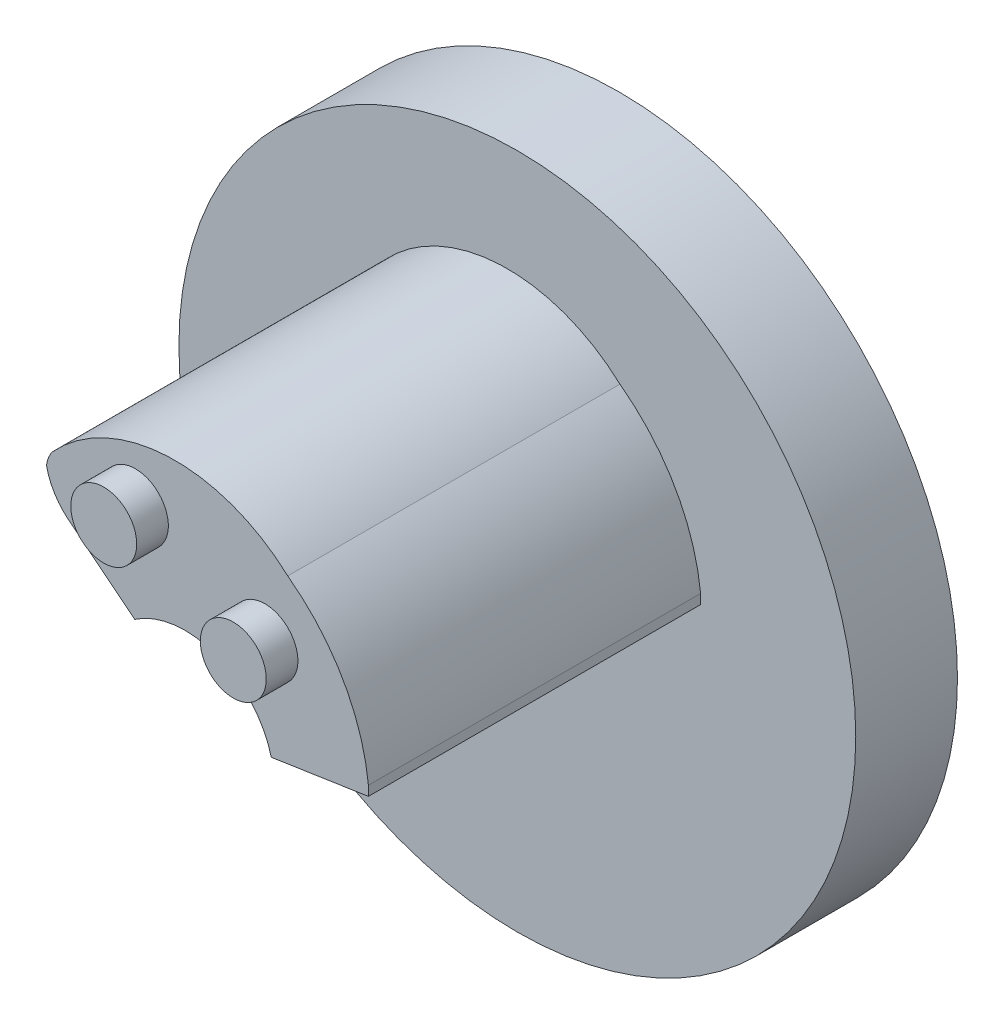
ISO-10303-21;
HEADER;
FILE_DESCRIPTION(('STEP AP214'),'2;1');
FILE_NAME('part.step','',(''),(''),'','','');
FILE_SCHEMA(('AUTOMOTIVE_DESIGN { 1 0 10303 214 1 1 1 1 }'));
ENDSEC;
DATA;
#1=APPLICATION_CONTEXT('core data for automotive mechanical design processes');
#2=APPLICATION_PROTOCOL_DEFINITION('international standard','automotive_design',2000,#1);
#3=PRODUCT_CONTEXT('',#1,'mechanical');
#4=PRODUCT('Part','Part','',(#3));
#5=PRODUCT_RELATED_PRODUCT_CATEGORY('part','',(#4));
#6=PRODUCT_DEFINITION_FORMATION('','',#4);
#7=PRODUCT_DEFINITION_CONTEXT('part definition',#1,'design');
#8=PRODUCT_DEFINITION('design','',#6,#7);
#9=PRODUCT_DEFINITION_SHAPE('','',#8);
#10=(LENGTH_UNIT() NAMED_UNIT(*) SI_UNIT(.MILLI.,.METRE.));
#11=(NAMED_UNIT(*) PLANE_ANGLE_UNIT() SI_UNIT($,.RADIAN.));
#12=(NAMED_UNIT(*) SI_UNIT($,.STERADIAN.) SOLID_ANGLE_UNIT());
#13=UNCERTAINTY_MEASURE_WITH_UNIT(LENGTH_MEASURE(1.E-05),#10,'distance_accuracy_value','');
#14=(GEOMETRIC_REPRESENTATION_CONTEXT(3) GLOBAL_UNCERTAINTY_ASSIGNED_CONTEXT((#13)) GLOBAL_UNIT_ASSIGNED_CONTEXT((#10,
#11,#12)) REPRESENTATION_CONTEXT('',''));
#15=CARTESIAN_POINT('',(0.,0.,0.));
#16=DIRECTION('',(0.,0.,1.));
#17=DIRECTION('',(1.,0.,0.));
#18=AXIS2_PLACEMENT_3D('',#15,#16,#17);
#19=CARTESIAN_POINT('',(-4.63184266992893,15.3950716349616,32.004));
#20=DIRECTION('',(0.,0.,-1.));
#21=DIRECTION('',(-1.,0.,0.));
#22=AXIS2_PLACEMENT_3D('',#19,#20,#21);
#23=CYLINDRICAL_SURFACE('',#22,6.11132036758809);
#24=DIRECTION('',(0.,0.,1.));
#25=VECTOR('',#24,1.);
#26=CARTESIAN_POINT('',(-10.6121911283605,14.1366325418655,17.526));
#27=LINE('',#26,#25);
#28=CARTESIAN_POINT('',(-10.6121911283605,14.1366325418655,0.));
#29=VERTEX_POINT('',#28);
#30=CARTESIAN_POINT('',(-10.6121911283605,14.1366325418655,32.004));
#31=VERTEX_POINT('',#30);
#32=EDGE_CURVE('E148',#29,#31,#27,.T.);
#33=ORIENTED_EDGE('',*,*,#32,.F.);
#34=CARTESIAN_POINT('',(-4.63184266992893,15.3950716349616,0.));
#35=DIRECTION('',(0.,0.,1.));
#36=DIRECTION('',(1.,0.,0.));
#37=AXIS2_PLACEMENT_3D('',#34,#35,#36);
#38=CIRCLE('',#37,6.11132036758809);
#39=CARTESIAN_POINT('',(-8.45110853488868,10.624176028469,0.));
#40=VERTEX_POINT('',#39);
#41=EDGE_CURVE('E166',#29,#40,#38,.T.);
#42=ORIENTED_EDGE('',*,*,#41,.T.);
#43=DIRECTION('',(0.,0.,-1.));
#44=VECTOR('',#43,1.);
#45=CARTESIAN_POINT('',(-8.45110853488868,10.624176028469,32.004));
#46=LINE('',#45,#44);
#47=CARTESIAN_POINT('',(-8.45110853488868,10.624176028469,32.004));
#48=VERTEX_POINT('',#47);
#49=EDGE_CURVE('E179',#48,#40,#46,.T.);
#50=ORIENTED_EDGE('',*,*,#49,.F.);
#51=CARTESIAN_POINT('',(-4.63184266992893,15.3950716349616,32.004));
#52=DIRECTION('',(0.,0.,1.));
#53=DIRECTION('',(1.,0.,0.));
#54=AXIS2_PLACEMENT_3D('',#51,#52,#53);
#55=CIRCLE('',#54,6.11132036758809);
#56=EDGE_CURVE('E169',#31,#48,#55,.T.);
#57=ORIENTED_EDGE('',*,*,#56,.F.);
#58=EDGE_LOOP('',(#33,#42,#50,#57));
#59=FACE_BOUND('',#58,.T.);
#60=ADVANCED_FACE('F42',(#59),#23,.T.);
#61=CARTESIAN_POINT('',(2.7435533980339,-1.51919399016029,32.004));
#62=DIRECTION('',(0.,0.,-1.));
#63=DIRECTION('',(-1.,0.,0.));
#64=AXIS2_PLACEMENT_3D('',#61,#62,#63);
#65=CYLINDRICAL_SURFACE('',#64,8.57250000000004);
#66=DIRECTION('',(0.,0.,-1.));
#67=VECTOR('',#66,1.);
#68=CARTESIAN_POINT('',(-2.10937907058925,5.54740368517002,32.004));
#69=LINE('',#68,#67);
#70=CARTESIAN_POINT('',(-2.10937907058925,5.54740368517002,32.004));
#71=VERTEX_POINT('',#70);
#72=CARTESIAN_POINT('',(-2.10937907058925,5.54740368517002,0.));
#73=VERTEX_POINT('',#72);
#74=EDGE_CURVE('E110',#71,#73,#69,.T.);
#75=ORIENTED_EDGE('',*,*,#74,.T.);
#76=CARTESIAN_POINT('',(2.7435533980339,-1.51919399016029,0.));
#77=DIRECTION('',(0.,0.,1.));
#78=DIRECTION('',(1.,0.,0.));
#79=AXIS2_PLACEMENT_3D('',#76,#77,#78);
#80=CIRCLE('',#79,8.57250000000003);
#81=CARTESIAN_POINT('',(11.0456569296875,0.616884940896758,0.));
#82=VERTEX_POINT('',#81);
#83=EDGE_CURVE('E105',#73,#82,#80,.T.);
#84=ORIENTED_EDGE('',*,*,#83,.T.);
#85=DIRECTION('',(0.,0.,1.));
#86=VECTOR('',#85,1.);
#87=CARTESIAN_POINT('',(11.0456569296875,0.616884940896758,-162.038491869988));
#88=LINE('',#87,#86);
#89=CARTESIAN_POINT('',(11.0456569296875,0.616884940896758,32.004));
#90=VERTEX_POINT('',#89);
#91=EDGE_CURVE('E109',#82,#90,#88,.T.);
#92=ORIENTED_EDGE('',*,*,#91,.T.);
#93=CARTESIAN_POINT('',(2.7435533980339,-1.51919399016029,32.004));
#94=DIRECTION('',(0.,0.,1.));
#95=DIRECTION('',(1.,0.,0.));
#96=AXIS2_PLACEMENT_3D('',#93,#94,#95);
#97=CIRCLE('',#96,8.57250000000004);
#98=EDGE_CURVE('E64',#90,#71,#97,.T.);
#99=ORIENTED_EDGE('',*,*,#98,.T.);
#100=EDGE_LOOP('',(#75,#84,#92,#99));
#101=FACE_BOUND('',#100,.T.);
#102=CARTESIAN_POINT('',(2.7435533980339,-1.51919399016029,-9.8));
#103=DIRECTION('',(0.,0.,1.));
#104=DIRECTION('',(1.,0.,0.));
#105=AXIS2_PLACEMENT_3D('',#102,#103,#104);
#106=CIRCLE('',#105,8.57250000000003);
#107=CARTESIAN_POINT('',(11.3160533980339,-1.51919399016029,-9.8));
#108=VERTEX_POINT('',#107);
#109=EDGE_CURVE('E115',#108,#108,#106,.T.);
#110=ORIENTED_EDGE('',*,*,#109,.F.);
#111=EDGE_LOOP('',(#110));
#112=FACE_BOUND('',#111,.T.);
#113=ADVANCED_FACE('F107',(#101,#112),#65,.F.);
#114=CARTESIAN_POINT('',(-1.60417169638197,-0.20353868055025,32.004));
#115=DIRECTION('',(0.,0.,1.));
#116=DIRECTION('',(1.,0.,0.));
#117=AXIS2_PLACEMENT_3D('',#114,#115,#116);
#118=PLANE('',#117);
#119=CARTESIAN_POINT('',(10.4302717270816,9.94696029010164,32.004));
#120=DIRECTION('',(0.,0.,1.));
#121=DIRECTION('',(1.,0.,0.));
#122=AXIS2_PLACEMENT_3D('',#119,#120,#121);
#123=CIRCLE('',#122,3.175);
#124=CARTESIAN_POINT('',(7.25527172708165,9.94696029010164,32.004));
#125=VERTEX_POINT('',#124);
#126=EDGE_CURVE('E157',#125,#125,#123,.T.);
#127=ORIENTED_EDGE('',*,*,#126,.F.);
#128=EDGE_LOOP('',(#127));
#129=FACE_BOUND('',#128,.T.);
#130=CARTESIAN_POINT('',(-2.0510247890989,14.9690204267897,32.004));
#131=DIRECTION('',(0.,0.,1.));
#132=DIRECTION('',(1.,0.,0.));
#133=AXIS2_PLACEMENT_3D('',#130,#131,#132);
#134=CIRCLE('',#133,3.175);
#135=CARTESIAN_POINT('',(-5.2260247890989,14.9690204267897,32.004));
#136=VERTEX_POINT('',#135);
#137=EDGE_CURVE('E160',#136,#136,#134,.T.);
#138=ORIENTED_EDGE('',*,*,#137,.F.);
#139=EDGE_LOOP('',(#138));
#140=FACE_BOUND('',#139,.T.);
#141=CARTESIAN_POINT('',(1.78231513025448,4.68272606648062,32.004));
#142=DIRECTION('',(0.,0.,1.));
#143=DIRECTION('',(1.,0.,0.));
#144=AXIS2_PLACEMENT_3D('',#141,#142,#143);
#145=CIRCLE('',#144,16.0701641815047);
#146=CARTESIAN_POINT('',(12.6284180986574,16.5407287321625,32.004));
#147=VERTEX_POINT('',#146);
#148=CARTESIAN_POINT('',(-10.0396309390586,15.5681184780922,32.004));
#149=VERTEX_POINT('',#148);
#150=EDGE_CURVE('E188',#147,#149,#145,.T.);
#151=ORIENTED_EDGE('',*,*,#150,.T.);
#152=CARTESIAN_POINT('',(-7.69142193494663,13.7986427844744,32.004));
#153=DIRECTION('',(0.,0.,1.));
#154=DIRECTION('',(1.,0.,0.));
#155=AXIS2_PLACEMENT_3D('',#152,#153,#154);
#156=CIRCLE('',#155,2.94026015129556);
#157=EDGE_CURVE('E144',#149,#31,#156,.T.);
#158=ORIENTED_EDGE('',*,*,#157,.T.);
#159=ORIENTED_EDGE('',*,*,#56,.T.);
#160=DIRECTION('',(-0.780665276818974,0.624949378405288,0.));
#161=VECTOR('',#160,1.);
#162=CARTESIAN_POINT('',(-2.10937907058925,5.54740368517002,32.004));
#163=LINE('',#162,#161);
#164=EDGE_CURVE('E171',#71,#48,#163,.T.);
#165=ORIENTED_EDGE('',*,*,#164,.F.);
#166=ORIENTED_EDGE('',*,*,#98,.F.);
#167=DIRECTION('',(0.988724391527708,0.149746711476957,0.));
#168=VECTOR('',#167,1.);
#169=CARTESIAN_POINT('',(-1.44198142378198,-1.27442349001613,32.004));
#170=LINE('',#169,#168);
#171=CARTESIAN_POINT('',(20.4006112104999,2.03373442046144,32.004));
#172=VERTEX_POINT('',#171);
#173=EDGE_CURVE('E121',#90,#172,#170,.T.);
#174=ORIENTED_EDGE('',*,*,#173,.T.);
#175=DIRECTION('',(0.,1.,0.));
#176=VECTOR('',#175,1.);
#177=CARTESIAN_POINT('',(20.4006112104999,-0.20353868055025,32.004));
#178=LINE('',#177,#176);
#179=CARTESIAN_POINT('',(20.4006112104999,2.96651204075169,32.004));
#180=VERTEX_POINT('',#179);
#181=EDGE_CURVE('E182',#172,#180,#178,.T.);
#182=ORIENTED_EDGE('',*,*,#181,.T.);
#183=CARTESIAN_POINT('',(1.12448254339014,0.941745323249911,32.004));
#184=DIRECTION('',(0.,0.,1.));
#185=DIRECTION('',(1.,0.,0.));
#186=AXIS2_PLACEMENT_3D('',#183,#184,#185);
#187=CIRCLE('',#186,19.3821778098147);
#188=EDGE_CURVE('E185',#180,#147,#187,.T.);
#189=ORIENTED_EDGE('',*,*,#188,.T.);
#190=EDGE_LOOP('',(#151,#158,#159,#165,#166,#174,#182,#189));
#191=FACE_BOUND('',#190,.T.);
#192=ADVANCED_FACE('F225',(#129,#140,#191),#118,.T.);
#193=CARTESIAN_POINT('',(-2.10937907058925,5.54740368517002,32.004));
#194=DIRECTION('',(-0.624949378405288,-0.780665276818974,0.));
#195=DIRECTION('',(0.780665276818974,-0.624949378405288,0.));
#196=AXIS2_PLACEMENT_3D('',#193,#194,#195);
#197=PLANE('',#196);
#198=DIRECTION('',(-0.780665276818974,0.624949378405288,0.));
#199=VECTOR('',#198,1.);
#200=CARTESIAN_POINT('',(-2.10937907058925,5.54740368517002,0.));
#201=LINE('',#200,#199);
#202=EDGE_CURVE('E172',#73,#40,#201,.T.);
#203=ORIENTED_EDGE('',*,*,#202,.F.);
#204=ORIENTED_EDGE('',*,*,#74,.F.);
#205=ORIENTED_EDGE('',*,*,#164,.T.);
#206=ORIENTED_EDGE('',*,*,#49,.T.);
#207=EDGE_LOOP('',(#203,#204,#205,#206));
#208=FACE_BOUND('',#207,.T.);
#209=ADVANCED_FACE('F233',(#208),#197,.T.);
#210=CARTESIAN_POINT('',(-2.0510247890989,14.9690204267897,35.052));
#211=DIRECTION('',(0.,0.,-1.));
#212=DIRECTION('',(-1.,0.,0.));
#213=AXIS2_PLACEMENT_3D('',#210,#211,#212);
#214=CYLINDRICAL_SURFACE('',#213,3.175);
#215=CARTESIAN_POINT('',(-2.0510247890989,14.9690204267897,35.052));
#216=DIRECTION('',(0.,0.,1.));
#217=DIRECTION('',(1.,0.,0.));
#218=AXIS2_PLACEMENT_3D('',#215,#216,#217);
#219=CIRCLE('',#218,3.175);
#220=CARTESIAN_POINT('',(-5.2260247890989,14.9690204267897,35.052));
#221=VERTEX_POINT('',#220);
#222=EDGE_CURVE('E163',#221,#221,#219,.T.);
#223=CARTESIAN_POINT('',(-5.2260247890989,14.9690204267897,35.052));
#224=CARTESIAN_POINT('',(-5.2260247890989,14.9690204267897,35.02025));
#225=CARTESIAN_POINT('',(-5.2260247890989,14.9690204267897,34.9885));
#226=CARTESIAN_POINT('',(-5.2260247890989,14.9690204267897,34.925));
#227=CARTESIAN_POINT('',(-5.2260247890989,14.9690204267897,34.89325));
#228=CARTESIAN_POINT('',(-5.2260247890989,14.9690204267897,34.82975));
#229=CARTESIAN_POINT('',(-5.2260247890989,14.9690204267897,34.798));
#230=CARTESIAN_POINT('',(-5.2260247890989,14.9690204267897,34.7345));
#231=CARTESIAN_POINT('',(-5.2260247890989,14.9690204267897,34.70275));
#232=CARTESIAN_POINT('',(-5.2260247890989,14.9690204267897,34.63925));
#233=CARTESIAN_POINT('',(-5.2260247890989,14.9690204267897,34.6075));
#234=CARTESIAN_POINT('',(-5.2260247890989,14.9690204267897,34.544));
#235=CARTESIAN_POINT('',(-5.2260247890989,14.9690204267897,34.51225));
#236=CARTESIAN_POINT('',(-5.2260247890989,14.9690204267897,34.44875));
#237=CARTESIAN_POINT('',(-5.2260247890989,14.9690204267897,34.417));
#238=CARTESIAN_POINT('',(-5.2260247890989,14.9690204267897,34.3535));
#239=CARTESIAN_POINT('',(-5.2260247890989,14.9690204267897,34.32175));
#240=CARTESIAN_POINT('',(-5.2260247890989,14.9690204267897,34.25825));
#241=CARTESIAN_POINT('',(-5.2260247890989,14.9690204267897,34.2265));
#242=CARTESIAN_POINT('',(-5.2260247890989,14.9690204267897,34.163));
#243=CARTESIAN_POINT('',(-5.2260247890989,14.9690204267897,34.13125));
#244=CARTESIAN_POINT('',(-5.2260247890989,14.9690204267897,34.06775));
#245=CARTESIAN_POINT('',(-5.2260247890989,14.9690204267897,34.036));
#246=CARTESIAN_POINT('',(-5.2260247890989,14.9690204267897,33.9725));
#247=CARTESIAN_POINT('',(-5.2260247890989,14.9690204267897,33.94075));
#248=CARTESIAN_POINT('',(-5.2260247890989,14.9690204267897,33.87725));
#249=CARTESIAN_POINT('',(-5.2260247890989,14.9690204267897,33.8455));
#250=CARTESIAN_POINT('',(-5.2260247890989,14.9690204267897,33.782));
#251=CARTESIAN_POINT('',(-5.2260247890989,14.9690204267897,33.75025));
#252=CARTESIAN_POINT('',(-5.2260247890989,14.9690204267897,33.68675));
#253=CARTESIAN_POINT('',(-5.2260247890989,14.9690204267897,33.655));
#254=CARTESIAN_POINT('',(-5.2260247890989,14.9690204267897,33.5915));
#255=CARTESIAN_POINT('',(-5.2260247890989,14.9690204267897,33.55975));
#256=CARTESIAN_POINT('',(-5.2260247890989,14.9690204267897,33.49625));
#257=CARTESIAN_POINT('',(-5.2260247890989,14.9690204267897,33.4645));
#258=CARTESIAN_POINT('',(-5.2260247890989,14.9690204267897,33.401));
#259=CARTESIAN_POINT('',(-5.2260247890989,14.9690204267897,33.36925));
#260=CARTESIAN_POINT('',(-5.2260247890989,14.9690204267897,33.30575));
#261=CARTESIAN_POINT('',(-5.2260247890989,14.9690204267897,33.274));
#262=CARTESIAN_POINT('',(-5.2260247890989,14.9690204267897,33.2105));
#263=CARTESIAN_POINT('',(-5.2260247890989,14.9690204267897,33.17875));
#264=CARTESIAN_POINT('',(-5.2260247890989,14.9690204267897,33.11525));
#265=CARTESIAN_POINT('',(-5.2260247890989,14.9690204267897,33.0835));
#266=CARTESIAN_POINT('',(-5.2260247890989,14.9690204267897,33.02));
#267=CARTESIAN_POINT('',(-5.2260247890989,14.9690204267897,32.98825));
#268=CARTESIAN_POINT('',(-5.2260247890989,14.9690204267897,32.92475));
#269=CARTESIAN_POINT('',(-5.2260247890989,14.9690204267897,32.893));
#270=CARTESIAN_POINT('',(-5.2260247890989,14.9690204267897,32.8295));
#271=CARTESIAN_POINT('',(-5.2260247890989,14.9690204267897,32.79775));
#272=CARTESIAN_POINT('',(-5.2260247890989,14.9690204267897,32.73425));
#273=CARTESIAN_POINT('',(-5.2260247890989,14.9690204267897,32.7025));
#274=CARTESIAN_POINT('',(-5.2260247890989,14.9690204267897,32.639));
#275=CARTESIAN_POINT('',(-5.2260247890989,14.9690204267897,32.60725));
#276=CARTESIAN_POINT('',(-5.2260247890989,14.9690204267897,32.54375));
#277=CARTESIAN_POINT('',(-5.2260247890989,14.9690204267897,32.512));
#278=CARTESIAN_POINT('',(-5.2260247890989,14.9690204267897,32.4485));
#279=CARTESIAN_POINT('',(-5.2260247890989,14.9690204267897,32.41675));
#280=CARTESIAN_POINT('',(-5.2260247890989,14.9690204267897,32.35325));
#281=CARTESIAN_POINT('',(-5.2260247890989,14.9690204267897,32.3215));
#282=CARTESIAN_POINT('',(-5.2260247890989,14.9690204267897,32.258));
#283=CARTESIAN_POINT('',(-5.2260247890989,14.9690204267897,32.22625));
#284=CARTESIAN_POINT('',(-5.2260247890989,14.9690204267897,32.16275));
#285=CARTESIAN_POINT('',(-5.2260247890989,14.9690204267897,32.131));
#286=CARTESIAN_POINT('',(-5.2260247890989,14.9690204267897,32.0675));
#287=CARTESIAN_POINT('',(-5.2260247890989,14.9690204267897,32.03575));
#288=CARTESIAN_POINT('',(-5.2260247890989,14.9690204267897,32.004));
#289=B_SPLINE_CURVE_WITH_KNOTS('',3,(#223,#224,#225,#226,#227,#228,#229,#230,#231,#232,#233,
#234,#235,#236,#237,#238,#239,#240,#241,#242,#243,#244,#245,#246,#247,#248,#249,#250,#251,#252,
#253,#254,#255,#256,#257,#258,#259,#260,#261,#262,#263,#264,#265,#266,#267,#268,#269,#270,#271,
#272,#273,#274,#275,#276,#277,#278,#279,#280,#281,#282,#283,#284,#285,#286,#287,#288),
.UNSPECIFIED.,.F.,.F.,(4,2,2,2,2,2,2,2,2,2,2,2,2,2,2,2,2,2,2,2,2,2,2,2,2,2,2,2,2,2,2,2,4),(0.,
0.0952500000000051,0.190500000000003,0.285750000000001,0.381000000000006,0.476250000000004,
0.571500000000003,0.666750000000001,0.762000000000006,0.857250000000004,0.952500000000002,
1.04775000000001,1.14300000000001,1.23825,1.3335,1.42875000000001,1.524,1.61925,
1.71450000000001,1.80975000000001,1.905,2.00025,2.09550000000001,2.19075000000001,2.286,2.38125,
2.47650000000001,2.57175,2.667,2.76225000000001,2.85750000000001,2.95275,3.048),.UNSPECIFIED.);
#290=EDGE_CURVE('BSEAM320',#221,#136,#289,.T.);
#291=ORIENTED_EDGE('',*,*,#222,.F.);
#292=ORIENTED_EDGE('',*,*,#137,.T.);
#293=ORIENTED_EDGE('',*,*,#290,.T.);
#294=ORIENTED_EDGE('',*,*,#290,.F.);
#295=EDGE_LOOP('',(#291,#293,#292,#294));
#296=FACE_BOUND('',#295,.T.);
#297=ADVANCED_FACE('F320',(#296),#214,.T.);
#298=CARTESIAN_POINT('',(-2.0510247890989,14.9690204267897,35.052));
#299=DIRECTION('',(0.,0.,1.));
#300=DIRECTION('',(1.,0.,0.));
#301=AXIS2_PLACEMENT_3D('',#298,#299,#300);
#302=PLANE('',#301);
#303=ORIENTED_EDGE('',*,*,#222,.T.);
#304=EDGE_LOOP('',(#303));
#305=FACE_BOUND('',#304,.T.);
#306=ADVANCED_FACE('F325',(#305),#302,.T.);
#307=CARTESIAN_POINT('',(10.4302717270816,9.94696029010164,35.052));
#308=DIRECTION('',(0.,0.,-1.));
#309=DIRECTION('',(-1.,0.,0.));
#310=AXIS2_PLACEMENT_3D('',#307,#308,#309);
#311=CYLINDRICAL_SURFACE('',#310,3.175);
#312=CARTESIAN_POINT('',(10.4302717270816,9.94696029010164,35.052));
#313=DIRECTION('',(0.,0.,1.));
#314=DIRECTION('',(1.,0.,0.));
#315=AXIS2_PLACEMENT_3D('',#312,#313,#314);
#316=CIRCLE('',#315,3.175);
#317=CARTESIAN_POINT('',(7.25527172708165,9.94696029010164,35.052));
#318=VERTEX_POINT('',#317);
#319=EDGE_CURVE('E154',#318,#318,#316,.T.);
#320=CARTESIAN_POINT('',(7.25527172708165,9.94696029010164,35.052));
#321=CARTESIAN_POINT('',(7.25527172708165,9.94696029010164,35.02025));
#322=CARTESIAN_POINT('',(7.25527172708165,9.94696029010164,34.9885));
#323=CARTESIAN_POINT('',(7.25527172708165,9.94696029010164,34.925));
#324=CARTESIAN_POINT('',(7.25527172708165,9.94696029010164,34.89325));
#325=CARTESIAN_POINT('',(7.25527172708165,9.94696029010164,34.82975));
#326=CARTESIAN_POINT('',(7.25527172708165,9.94696029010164,34.798));
#327=CARTESIAN_POINT('',(7.25527172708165,9.94696029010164,34.7345));
#328=CARTESIAN_POINT('',(7.25527172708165,9.94696029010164,34.70275));
#329=CARTESIAN_POINT('',(7.25527172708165,9.94696029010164,34.63925));
#330=CARTESIAN_POINT('',(7.25527172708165,9.94696029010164,34.6075));
#331=CARTESIAN_POINT('',(7.25527172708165,9.94696029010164,34.544));
#332=CARTESIAN_POINT('',(7.25527172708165,9.94696029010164,34.51225));
#333=CARTESIAN_POINT('',(7.25527172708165,9.94696029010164,34.44875));
#334=CARTESIAN_POINT('',(7.25527172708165,9.94696029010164,34.417));
#335=CARTESIAN_POINT('',(7.25527172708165,9.94696029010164,34.3535));
#336=CARTESIAN_POINT('',(7.25527172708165,9.94696029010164,34.32175));
#337=CARTESIAN_POINT('',(7.25527172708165,9.94696029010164,34.25825));
#338=CARTESIAN_POINT('',(7.25527172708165,9.94696029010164,34.2265));
#339=CARTESIAN_POINT('',(7.25527172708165,9.94696029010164,34.163));
#340=CARTESIAN_POINT('',(7.25527172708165,9.94696029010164,34.13125));
#341=CARTESIAN_POINT('',(7.25527172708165,9.94696029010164,34.06775));
#342=CARTESIAN_POINT('',(7.25527172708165,9.94696029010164,34.036));
#343=CARTESIAN_POINT('',(7.25527172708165,9.94696029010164,33.9725));
#344=CARTESIAN_POINT('',(7.25527172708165,9.94696029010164,33.94075));
#345=CARTESIAN_POINT('',(7.25527172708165,9.94696029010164,33.87725));
#346=CARTESIAN_POINT('',(7.25527172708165,9.94696029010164,33.8455));
#347=CARTESIAN_POINT('',(7.25527172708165,9.94696029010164,33.782));
#348=CARTESIAN_POINT('',(7.25527172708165,9.94696029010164,33.75025));
#349=CARTESIAN_POINT('',(7.25527172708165,9.94696029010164,33.68675));
#350=CARTESIAN_POINT('',(7.25527172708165,9.94696029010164,33.655));
#351=CARTESIAN_POINT('',(7.25527172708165,9.94696029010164,33.5915));
#352=CARTESIAN_POINT('',(7.25527172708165,9.94696029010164,33.55975));
#353=CARTESIAN_POINT('',(7.25527172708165,9.94696029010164,33.49625));
#354=CARTESIAN_POINT('',(7.25527172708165,9.94696029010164,33.4645));
#355=CARTESIAN_POINT('',(7.25527172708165,9.94696029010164,33.401));
#356=CARTESIAN_POINT('',(7.25527172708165,9.94696029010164,33.36925));
#357=CARTESIAN_POINT('',(7.25527172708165,9.94696029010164,33.30575));
#358=CARTESIAN_POINT('',(7.25527172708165,9.94696029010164,33.274));
#359=CARTESIAN_POINT('',(7.25527172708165,9.94696029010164,33.2105));
#360=CARTESIAN_POINT('',(7.25527172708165,9.94696029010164,33.17875));
#361=CARTESIAN_POINT('',(7.25527172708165,9.94696029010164,33.11525));
#362=CARTESIAN_POINT('',(7.25527172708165,9.94696029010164,33.0835));
#363=CARTESIAN_POINT('',(7.25527172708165,9.94696029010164,33.02));
#364=CARTESIAN_POINT('',(7.25527172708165,9.94696029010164,32.98825));
#365=CARTESIAN_POINT('',(7.25527172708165,9.94696029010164,32.92475));
#366=CARTESIAN_POINT('',(7.25527172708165,9.94696029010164,32.893));
#367=CARTESIAN_POINT('',(7.25527172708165,9.94696029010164,32.8295));
#368=CARTESIAN_POINT('',(7.25527172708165,9.94696029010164,32.79775));
#369=CARTESIAN_POINT('',(7.25527172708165,9.94696029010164,32.73425));
#370=CARTESIAN_POINT('',(7.25527172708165,9.94696029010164,32.7025));
#371=CARTESIAN_POINT('',(7.25527172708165,9.94696029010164,32.639));
#372=CARTESIAN_POINT('',(7.25527172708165,9.94696029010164,32.60725));
#373=CARTESIAN_POINT('',(7.25527172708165,9.94696029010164,32.54375));
#374=CARTESIAN_POINT('',(7.25527172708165,9.94696029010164,32.512));
#375=CARTESIAN_POINT('',(7.25527172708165,9.94696029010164,32.4485));
#376=CARTESIAN_POINT('',(7.25527172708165,9.94696029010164,32.41675));
#377=CARTESIAN_POINT('',(7.25527172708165,9.94696029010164,32.35325));
#378=CARTESIAN_POINT('',(7.25527172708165,9.94696029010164,32.3215));
#379=CARTESIAN_POINT('',(7.25527172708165,9.94696029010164,32.258));
#380=CARTESIAN_POINT('',(7.25527172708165,9.94696029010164,32.22625));
#381=CARTESIAN_POINT('',(7.25527172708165,9.94696029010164,32.16275));
#382=CARTESIAN_POINT('',(7.25527172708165,9.94696029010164,32.131));
#383=CARTESIAN_POINT('',(7.25527172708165,9.94696029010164,32.0675));
#384=CARTESIAN_POINT('',(7.25527172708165,9.94696029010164,32.03575));
#385=CARTESIAN_POINT('',(7.25527172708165,9.94696029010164,32.004));
#386=B_SPLINE_CURVE_WITH_KNOTS('',3,(#320,#321,#322,#323,#324,#325,#326,#327,#328,#329,#330,
#331,#332,#333,#334,#335,#336,#337,#338,#339,#340,#341,#342,#343,#344,#345,#346,#347,#348,#349,
#350,#351,#352,#353,#354,#355,#356,#357,#358,#359,#360,#361,#362,#363,#364,#365,#366,#367,#368,
#369,#370,#371,#372,#373,#374,#375,#376,#377,#378,#379,#380,#381,#382,#383,#384,#385),
.UNSPECIFIED.,.F.,.F.,(4,2,2,2,2,2,2,2,2,2,2,2,2,2,2,2,2,2,2,2,2,2,2,2,2,2,2,2,2,2,2,2,4),(0.,
0.0952500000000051,0.190500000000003,0.285750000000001,0.381000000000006,0.476250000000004,
0.571500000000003,0.666750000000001,0.762000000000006,0.857250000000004,0.952500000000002,
1.04775000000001,1.14300000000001,1.23825,1.3335,1.42875000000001,1.524,1.61925,
1.71450000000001,1.80975000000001,1.905,2.00025,2.09550000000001,2.19075000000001,2.286,2.38125,
2.47650000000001,2.57175,2.667,2.76225000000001,2.85750000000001,2.95275,3.048),.UNSPECIFIED.);
#387=EDGE_CURVE('BSEAM336',#318,#125,#386,.T.);
#388=ORIENTED_EDGE('',*,*,#319,.F.);
#389=ORIENTED_EDGE('',*,*,#126,.T.);
#390=ORIENTED_EDGE('',*,*,#387,.T.);
#391=ORIENTED_EDGE('',*,*,#387,.F.);
#392=EDGE_LOOP('',(#388,#390,#389,#391));
#393=FACE_BOUND('',#392,.T.);
#394=ADVANCED_FACE('F336',(#393),#311,.T.);
#395=CARTESIAN_POINT('',(10.4302717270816,9.94696029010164,35.052));
#396=DIRECTION('',(0.,0.,1.));
#397=DIRECTION('',(1.,0.,0.));
#398=AXIS2_PLACEMENT_3D('',#395,#396,#397);
#399=PLANE('',#398);
#400=ORIENTED_EDGE('',*,*,#319,.T.);
#401=EDGE_LOOP('',(#400));
#402=FACE_BOUND('',#401,.T.);
#403=ADVANCED_FACE('F208',(#402),#399,.T.);
#404=CARTESIAN_POINT('',(2.7435533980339,-1.51919399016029,-9.8));
#405=DIRECTION('',(0.,0.,1.));
#406=DIRECTION('',(1.,0.,0.));
#407=AXIS2_PLACEMENT_3D('',#404,#405,#406);
#408=CYLINDRICAL_SURFACE('',#407,32.6053346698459);
#409=CARTESIAN_POINT('',(2.7435533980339,-1.51919399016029,-9.8));
#410=DIRECTION('',(0.,0.,-1.));
#411=DIRECTION('',(-1.,0.,0.));
#412=AXIS2_PLACEMENT_3D('',#409,#410,#411);
#413=CIRCLE('',#412,32.6053346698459);
#414=CARTESIAN_POINT('',(-29.861781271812,-1.51919399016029,-9.8));
#415=VERTEX_POINT('',#414);
#416=EDGE_CURVE('E151',#415,#415,#413,.T.);
#417=ORIENTED_EDGE('',*,*,#416,.F.);
#418=EDGE_LOOP('',(#417));
#419=FACE_BOUND('',#418,.T.);
#420=CARTESIAN_POINT('',(2.7435533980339,-1.51919399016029,0.));
#421=DIRECTION('',(0.,0.,-1.));
#422=DIRECTION('',(-1.,0.,0.));
#423=AXIS2_PLACEMENT_3D('',#420,#421,#422);
#424=CIRCLE('',#423,32.6053346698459);
#425=CARTESIAN_POINT('',(-29.861781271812,-1.51919399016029,0.));
#426=VERTEX_POINT('',#425);
#427=EDGE_CURVE('E150',#426,#426,#424,.T.);
#428=ORIENTED_EDGE('',*,*,#427,.T.);
#429=EDGE_LOOP('',(#428));
#430=FACE_BOUND('',#429,.T.);
#431=ADVANCED_FACE('F198',(#419,#430),#408,.T.);
#432=CARTESIAN_POINT('',(2.7435533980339,-1.51919399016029,-9.8));
#433=DIRECTION('',(0.,0.,-1.));
#434=DIRECTION('',(-1.,0.,0.));
#435=AXIS2_PLACEMENT_3D('',#432,#433,#434);
#436=PLANE('',#435);
#437=CARTESIAN_POINT('',(10.4302717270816,9.94696029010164,-9.8));
#438=DIRECTION('',(0.,0.,-1.));
#439=DIRECTION('',(-1.,0.,0.));
#440=AXIS2_PLACEMENT_3D('',#437,#438,#439);
#441=CIRCLE('',#440,3.175);
#442=CARTESIAN_POINT('',(13.6052717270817,9.94696029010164,-9.8));
#443=VERTEX_POINT('',#442);
#444=EDGE_CURVE('E11',#443,#443,#441,.T.);
#445=ORIENTED_EDGE('',*,*,#444,.F.);
#446=EDGE_LOOP('',(#445));
#447=FACE_BOUND('',#446,.T.);
#448=CARTESIAN_POINT('',(-2.0510247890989,14.9690204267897,-9.8));
#449=DIRECTION('',(0.,0.,-1.));
#450=DIRECTION('',(-1.,0.,0.));
#451=AXIS2_PLACEMENT_3D('',#448,#449,#450);
#452=CIRCLE('',#451,3.175);
#453=CARTESIAN_POINT('',(1.1239752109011,14.9690204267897,-9.8));
#454=VERTEX_POINT('',#453);
#455=EDGE_CURVE('E49',#454,#454,#452,.T.);
#456=ORIENTED_EDGE('',*,*,#455,.F.);
#457=EDGE_LOOP('',(#456));
#458=FACE_BOUND('',#457,.T.);
#459=ORIENTED_EDGE('',*,*,#109,.T.);
#460=EDGE_LOOP('',(#459));
#461=FACE_BOUND('',#460,.T.);
#462=ORIENTED_EDGE('',*,*,#416,.T.);
#463=EDGE_LOOP('',(#462));
#464=FACE_BOUND('',#463,.T.);
#465=ADVANCED_FACE('F195',(#447,#458,#461,#464),#436,.T.);
#466=CARTESIAN_POINT('',(2.7435533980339,-1.51919399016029,0.));
#467=DIRECTION('',(0.,0.,-1.));
#468=DIRECTION('',(-1.,0.,0.));
#469=AXIS2_PLACEMENT_3D('',#466,#467,#468);
#470=PLANE('',#469);
#471=DIRECTION('',(0.988724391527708,0.149746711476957,0.));
#472=VECTOR('',#471,1.);
#473=CARTESIAN_POINT('',(11.0456569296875,0.616884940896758,0.));
#474=LINE('',#473,#472);
#475=CARTESIAN_POINT('',(20.4006112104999,2.03373442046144,0.));
#476=VERTEX_POINT('',#475);
#477=EDGE_CURVE('E119',#82,#476,#474,.T.);
#478=ORIENTED_EDGE('',*,*,#477,.F.);
#479=ORIENTED_EDGE('',*,*,#83,.F.);
#480=ORIENTED_EDGE('',*,*,#202,.T.);
#481=ORIENTED_EDGE('',*,*,#41,.F.);
#482=CARTESIAN_POINT('',(-7.69142193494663,13.7986427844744,0.));
#483=DIRECTION('',(0.,0.,-1.));
#484=DIRECTION('',(-1.,0.,0.));
#485=AXIS2_PLACEMENT_3D('',#482,#483,#484);
#486=CIRCLE('',#485,2.94026015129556);
#487=CARTESIAN_POINT('',(-10.0396309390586,15.5681184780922,0.));
#488=VERTEX_POINT('',#487);
#489=EDGE_CURVE('E145',#488,#29,#486,.F.);
#490=ORIENTED_EDGE('',*,*,#489,.F.);
#491=CARTESIAN_POINT('',(1.78231513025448,4.68272606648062,0.));
#492=DIRECTION('',(0.,0.,-1.));
#493=DIRECTION('',(-1.,0.,0.));
#494=AXIS2_PLACEMENT_3D('',#491,#492,#493);
#495=CIRCLE('',#494,16.0701641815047);
#496=CARTESIAN_POINT('',(12.6284180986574,16.5407287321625,0.));
#497=VERTEX_POINT('',#496);
#498=EDGE_CURVE('E239',#497,#488,#495,.F.);
#499=ORIENTED_EDGE('',*,*,#498,.F.);
#500=CARTESIAN_POINT('',(1.12448254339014,0.941745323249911,0.));
#501=DIRECTION('',(0.,0.,-1.));
#502=DIRECTION('',(-1.,0.,0.));
#503=AXIS2_PLACEMENT_3D('',#500,#501,#502);
#504=CIRCLE('',#503,19.3821778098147);
#505=CARTESIAN_POINT('',(20.4006112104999,2.96651204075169,0.));
#506=VERTEX_POINT('',#505);
#507=EDGE_CURVE('E129',#506,#497,#504,.F.);
#508=ORIENTED_EDGE('',*,*,#507,.F.);
#509=DIRECTION('',(0.,1.,0.));
#510=VECTOR('',#509,1.);
#511=CARTESIAN_POINT('',(20.4006112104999,2.9665120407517,0.));
#512=LINE('',#511,#510);
#513=EDGE_CURVE('E127',#476,#506,#512,.T.);
#514=ORIENTED_EDGE('',*,*,#513,.F.);
#515=EDGE_LOOP('',(#478,#479,#480,#481,#490,#499,#508,#514));
#516=FACE_BOUND('',#515,.T.);
#517=ORIENTED_EDGE('',*,*,#427,.F.);
#518=EDGE_LOOP('',(#517));
#519=FACE_BOUND('',#518,.T.);
#520=ADVANCED_FACE('F124',(#516,#519),#470,.F.);
#521=CARTESIAN_POINT('',(-7.69142193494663,13.7986427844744,-162.038491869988));
#522=DIRECTION('',(0.,0.,1.));
#523=DIRECTION('',(1.,0.,0.));
#524=AXIS2_PLACEMENT_3D('',#521,#522,#523);
#525=CYLINDRICAL_SURFACE('',#524,2.94026015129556);
#526=ORIENTED_EDGE('',*,*,#32,.T.);
#527=ORIENTED_EDGE('',*,*,#157,.F.);
#528=DIRECTION('',(0.,0.,1.));
#529=VECTOR('',#528,1.);
#530=CARTESIAN_POINT('',(-10.0396309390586,15.5681184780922,-162.038491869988));
#531=LINE('',#530,#529);
#532=EDGE_CURVE('E133',#488,#149,#531,.T.);
#533=ORIENTED_EDGE('',*,*,#532,.F.);
#534=ORIENTED_EDGE('',*,*,#489,.T.);
#535=EDGE_LOOP('',(#526,#527,#533,#534));
#536=FACE_BOUND('',#535,.T.);
#537=ADVANCED_FACE('F212',(#536),#525,.T.);
#538=CARTESIAN_POINT('',(1.78231513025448,4.68272606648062,-162.038491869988));
#539=DIRECTION('',(0.,0.,1.));
#540=DIRECTION('',(1.,0.,0.));
#541=AXIS2_PLACEMENT_3D('',#538,#539,#540);
#542=CYLINDRICAL_SURFACE('',#541,16.0701641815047);
#543=DIRECTION('',(0.,0.,1.));
#544=VECTOR('',#543,1.);
#545=CARTESIAN_POINT('',(12.6284180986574,16.5407287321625,-162.038491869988));
#546=LINE('',#545,#544);
#547=EDGE_CURVE('E136',#497,#147,#546,.T.);
#548=ORIENTED_EDGE('',*,*,#547,.F.);
#549=ORIENTED_EDGE('',*,*,#498,.T.);
#550=ORIENTED_EDGE('',*,*,#532,.T.);
#551=ORIENTED_EDGE('',*,*,#150,.F.);
#552=EDGE_LOOP('',(#548,#549,#550,#551));
#553=FACE_BOUND('',#552,.T.);
#554=ADVANCED_FACE('F217',(#553),#542,.T.);
#555=CARTESIAN_POINT('',(1.12448254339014,0.941745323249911,-162.038491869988));
#556=DIRECTION('',(0.,0.,1.));
#557=DIRECTION('',(1.,0.,0.));
#558=AXIS2_PLACEMENT_3D('',#555,#556,#557);
#559=CYLINDRICAL_SURFACE('',#558,19.3821778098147);
#560=DIRECTION('',(0.,0.,1.));
#561=VECTOR('',#560,1.);
#562=CARTESIAN_POINT('',(20.4006112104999,2.96651204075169,-162.038491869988));
#563=LINE('',#562,#561);
#564=EDGE_CURVE('E139',#506,#180,#563,.T.);
#565=ORIENTED_EDGE('',*,*,#564,.F.);
#566=ORIENTED_EDGE('',*,*,#507,.T.);
#567=ORIENTED_EDGE('',*,*,#547,.T.);
#568=ORIENTED_EDGE('',*,*,#188,.F.);
#569=EDGE_LOOP('',(#565,#566,#567,#568));
#570=FACE_BOUND('',#569,.T.);
#571=ADVANCED_FACE('F274',(#570),#559,.T.);
#572=CARTESIAN_POINT('',(20.4006112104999,2.9665120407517,-162.038491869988));
#573=DIRECTION('',(1.,0.,0.));
#574=DIRECTION('',(0.,0.,-1.));
#575=AXIS2_PLACEMENT_3D('',#572,#573,#574);
#576=PLANE('',#575);
#577=DIRECTION('',(0.,0.,1.));
#578=VECTOR('',#577,1.);
#579=CARTESIAN_POINT('',(20.4006112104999,2.03373442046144,-162.038491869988));
#580=LINE('',#579,#578);
#581=EDGE_CURVE('E56',#476,#172,#580,.T.);
#582=ORIENTED_EDGE('',*,*,#581,.F.);
#583=ORIENTED_EDGE('',*,*,#513,.T.);
#584=ORIENTED_EDGE('',*,*,#564,.T.);
#585=ORIENTED_EDGE('',*,*,#181,.F.);
#586=EDGE_LOOP('',(#582,#583,#584,#585));
#587=FACE_BOUND('',#586,.T.);
#588=ADVANCED_FACE('F271',(#587),#576,.T.);
#589=CARTESIAN_POINT('',(11.0456569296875,0.616884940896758,-162.038491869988));
#590=DIRECTION('',(0.149746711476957,-0.988724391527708,0.));
#591=DIRECTION('',(0.988724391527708,0.149746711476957,0.));
#592=AXIS2_PLACEMENT_3D('',#589,#590,#591);
#593=PLANE('',#592);
#594=ORIENTED_EDGE('',*,*,#91,.F.);
#595=ORIENTED_EDGE('',*,*,#477,.T.);
#596=ORIENTED_EDGE('',*,*,#581,.T.);
#597=ORIENTED_EDGE('',*,*,#173,.F.);
#598=EDGE_LOOP('',(#594,#595,#596,#597));
#599=FACE_BOUND('',#598,.T.);
#600=ADVANCED_FACE('F118',(#599),#593,.T.);
#601=CARTESIAN_POINT('',(-2.0510247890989,14.9690204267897,-12.848));
#602=DIRECTION('',(0.,0.,1.));
#603=DIRECTION('',(1.,0.,0.));
#604=AXIS2_PLACEMENT_3D('',#601,#602,#603);
#605=CYLINDRICAL_SURFACE('',#604,3.175);
#606=CARTESIAN_POINT('',(-2.0510247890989,14.9690204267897,-12.848));
#607=DIRECTION('',(0.,0.,1.));
#608=DIRECTION('',(1.,0.,0.));
#609=AXIS2_PLACEMENT_3D('',#606,#607,#608);
#610=CIRCLE('',#609,3.175);
#611=CARTESIAN_POINT('',(1.1239752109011,14.9690204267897,-12.848));
#612=VERTEX_POINT('',#611);
#613=EDGE_CURVE('E116',#612,#612,#610,.T.);
#614=CARTESIAN_POINT('',(1.1239752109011,14.9690204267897,-12.848));
#615=CARTESIAN_POINT('',(1.1239752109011,14.9690204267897,-12.81625));
#616=CARTESIAN_POINT('',(1.1239752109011,14.9690204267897,-12.7845));
#617=CARTESIAN_POINT('',(1.1239752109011,14.9690204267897,-12.721));
#618=CARTESIAN_POINT('',(1.1239752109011,14.9690204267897,-12.68925));
#619=CARTESIAN_POINT('',(1.1239752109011,14.9690204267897,-12.62575));
#620=CARTESIAN_POINT('',(1.1239752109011,14.9690204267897,-12.594));
#621=CARTESIAN_POINT('',(1.1239752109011,14.9690204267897,-12.5305));
#622=CARTESIAN_POINT('',(1.1239752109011,14.9690204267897,-12.49875));
#623=CARTESIAN_POINT('',(1.1239752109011,14.9690204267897,-12.43525));
#624=CARTESIAN_POINT('',(1.1239752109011,14.9690204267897,-12.4035));
#625=CARTESIAN_POINT('',(1.1239752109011,14.9690204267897,-12.34));
#626=CARTESIAN_POINT('',(1.1239752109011,14.9690204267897,-12.30825));
#627=CARTESIAN_POINT('',(1.1239752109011,14.9690204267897,-12.24475));
#628=CARTESIAN_POINT('',(1.1239752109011,14.9690204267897,-12.213));
#629=CARTESIAN_POINT('',(1.1239752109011,14.9690204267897,-12.1495));
#630=CARTESIAN_POINT('',(1.1239752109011,14.9690204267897,-12.11775));
#631=CARTESIAN_POINT('',(1.1239752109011,14.9690204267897,-12.05425));
#632=CARTESIAN_POINT('',(1.1239752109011,14.9690204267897,-12.0225));
#633=CARTESIAN_POINT('',(1.1239752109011,14.9690204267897,-11.959));
#634=CARTESIAN_POINT('',(1.1239752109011,14.9690204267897,-11.92725));
#635=CARTESIAN_POINT('',(1.1239752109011,14.9690204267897,-11.86375));
#636=CARTESIAN_POINT('',(1.1239752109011,14.9690204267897,-11.832));
#637=CARTESIAN_POINT('',(1.1239752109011,14.9690204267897,-11.7685));
#638=CARTESIAN_POINT('',(1.1239752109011,14.9690204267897,-11.73675));
#639=CARTESIAN_POINT('',(1.1239752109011,14.9690204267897,-11.67325));
#640=CARTESIAN_POINT('',(1.1239752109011,14.9690204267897,-11.6415));
#641=CARTESIAN_POINT('',(1.1239752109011,14.9690204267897,-11.578));
#642=CARTESIAN_POINT('',(1.1239752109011,14.9690204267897,-11.54625));
#643=CARTESIAN_POINT('',(1.1239752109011,14.9690204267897,-11.48275));
#644=CARTESIAN_POINT('',(1.1239752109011,14.9690204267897,-11.451));
#645=CARTESIAN_POINT('',(1.1239752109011,14.9690204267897,-11.3875));
#646=CARTESIAN_POINT('',(1.1239752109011,14.9690204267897,-11.35575));
#647=CARTESIAN_POINT('',(1.1239752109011,14.9690204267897,-11.29225));
#648=CARTESIAN_POINT('',(1.1239752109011,14.9690204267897,-11.2605));
#649=CARTESIAN_POINT('',(1.1239752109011,14.9690204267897,-11.197));
#650=CARTESIAN_POINT('',(1.1239752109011,14.9690204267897,-11.16525));
#651=CARTESIAN_POINT('',(1.1239752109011,14.9690204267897,-11.10175));
#652=CARTESIAN_POINT('',(1.1239752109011,14.9690204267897,-11.07));
#653=CARTESIAN_POINT('',(1.1239752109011,14.9690204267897,-11.0065));
#654=CARTESIAN_POINT('',(1.1239752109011,14.9690204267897,-10.97475));
#655=CARTESIAN_POINT('',(1.1239752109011,14.9690204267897,-10.91125));
#656=CARTESIAN_POINT('',(1.1239752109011,14.9690204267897,-10.8795));
#657=CARTESIAN_POINT('',(1.1239752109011,14.9690204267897,-10.816));
#658=CARTESIAN_POINT('',(1.1239752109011,14.9690204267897,-10.78425));
#659=CARTESIAN_POINT('',(1.1239752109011,14.9690204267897,-10.72075));
#660=CARTESIAN_POINT('',(1.1239752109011,14.9690204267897,-10.689));
#661=CARTESIAN_POINT('',(1.1239752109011,14.9690204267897,-10.6255));
#662=CARTESIAN_POINT('',(1.1239752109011,14.9690204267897,-10.59375));
#663=CARTESIAN_POINT('',(1.1239752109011,14.9690204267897,-10.53025));
#664=CARTESIAN_POINT('',(1.1239752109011,14.9690204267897,-10.4985));
#665=CARTESIAN_POINT('',(1.1239752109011,14.9690204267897,-10.435));
#666=CARTESIAN_POINT('',(1.1239752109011,14.9690204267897,-10.40325));
#667=CARTESIAN_POINT('',(1.1239752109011,14.9690204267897,-10.33975));
#668=CARTESIAN_POINT('',(1.1239752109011,14.9690204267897,-10.308));
#669=CARTESIAN_POINT('',(1.1239752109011,14.9690204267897,-10.2445));
#670=CARTESIAN_POINT('',(1.1239752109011,14.9690204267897,-10.21275));
#671=CARTESIAN_POINT('',(1.1239752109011,14.9690204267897,-10.14925));
#672=CARTESIAN_POINT('',(1.1239752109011,14.9690204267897,-10.1175));
#673=CARTESIAN_POINT('',(1.1239752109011,14.9690204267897,-10.054));
#674=CARTESIAN_POINT('',(1.1239752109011,14.9690204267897,-10.02225));
#675=CARTESIAN_POINT('',(1.1239752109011,14.9690204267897,-9.95875));
#676=CARTESIAN_POINT('',(1.1239752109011,14.9690204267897,-9.927));
#677=CARTESIAN_POINT('',(1.1239752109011,14.9690204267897,-9.8635));
#678=CARTESIAN_POINT('',(1.1239752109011,14.9690204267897,-9.83175));
#679=CARTESIAN_POINT('',(1.1239752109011,14.9690204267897,-9.8));
#680=B_SPLINE_CURVE_WITH_KNOTS('',3,(#614,#615,#616,#617,#618,#619,#620,#621,#622,#623,#624,
#625,#626,#627,#628,#629,#630,#631,#632,#633,#634,#635,#636,#637,#638,#639,#640,#641,#642,#643,
#644,#645,#646,#647,#648,#649,#650,#651,#652,#653,#654,#655,#656,#657,#658,#659,#660,#661,#662,
#663,#664,#665,#666,#667,#668,#669,#670,#671,#672,#673,#674,#675,#676,#677,#678,#679),
.UNSPECIFIED.,.F.,.F.,(4,2,2,2,2,2,2,2,2,2,2,2,2,2,2,2,2,2,2,2,2,2,2,2,2,2,2,2,2,2,2,2,4),(0.,
0.0952499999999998,0.1905,0.28575,0.380999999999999,0.476249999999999,0.571499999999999,
0.666750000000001,0.762000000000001,0.85725,0.9525,1.04775,1.143,1.23825,1.3335,1.42875,1.524,
1.61925,1.7145,1.80975,1.905,2.00025,2.0955,2.19075,2.286,2.38125,2.4765,2.57175,2.667,2.76225,
2.8575,2.95275,3.048),.UNSPECIFIED.);
#681=EDGE_CURVE('BSEAM193',#612,#454,#680,.T.);
#682=ORIENTED_EDGE('',*,*,#613,.T.);
#683=ORIENTED_EDGE('',*,*,#455,.T.);
#684=ORIENTED_EDGE('',*,*,#681,.T.);
#685=ORIENTED_EDGE('',*,*,#681,.F.);
#686=EDGE_LOOP('',(#682,#684,#683,#685));
#687=FACE_BOUND('',#686,.T.);
#688=ADVANCED_FACE('F193',(#687),#605,.T.);
#689=CARTESIAN_POINT('',(-2.0510247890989,14.9690204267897,-12.848));
#690=DIRECTION('',(0.,0.,-1.));
#691=DIRECTION('',(1.,0.,0.));
#692=AXIS2_PLACEMENT_3D('',#689,#690,#691);
#693=PLANE('',#692);
#694=ORIENTED_EDGE('',*,*,#613,.F.);
#695=EDGE_LOOP('',(#694));
#696=FACE_BOUND('',#695,.T.);
#697=ADVANCED_FACE('F260',(#696),#693,.T.);
#698=CARTESIAN_POINT('',(10.4302717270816,9.94696029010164,-12.848));
#699=DIRECTION('',(0.,0.,1.));
#700=DIRECTION('',(1.,0.,0.));
#701=AXIS2_PLACEMENT_3D('',#698,#699,#700);
#702=CYLINDRICAL_SURFACE('',#701,3.175);
#703=CARTESIAN_POINT('',(10.4302717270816,9.94696029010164,-12.848));
#704=DIRECTION('',(0.,0.,1.));
#705=DIRECTION('',(1.,0.,0.));
#706=AXIS2_PLACEMENT_3D('',#703,#704,#705);
#707=CIRCLE('',#706,3.175);
#708=CARTESIAN_POINT('',(13.6052717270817,9.94696029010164,-12.848));
#709=VERTEX_POINT('',#708);
#710=EDGE_CURVE('E247',#709,#709,#707,.T.);
#711=CARTESIAN_POINT('',(13.6052717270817,9.94696029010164,-12.848));
#712=CARTESIAN_POINT('',(13.6052717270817,9.94696029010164,-12.81625));
#713=CARTESIAN_POINT('',(13.6052717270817,9.94696029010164,-12.7845));
#714=CARTESIAN_POINT('',(13.6052717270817,9.94696029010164,-12.721));
#715=CARTESIAN_POINT('',(13.6052717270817,9.94696029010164,-12.68925));
#716=CARTESIAN_POINT('',(13.6052717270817,9.94696029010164,-12.62575));
#717=CARTESIAN_POINT('',(13.6052717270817,9.94696029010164,-12.594));
#718=CARTESIAN_POINT('',(13.6052717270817,9.94696029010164,-12.5305));
#719=CARTESIAN_POINT('',(13.6052717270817,9.94696029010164,-12.49875));
#720=CARTESIAN_POINT('',(13.6052717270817,9.94696029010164,-12.43525));
#721=CARTESIAN_POINT('',(13.6052717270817,9.94696029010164,-12.4035));
#722=CARTESIAN_POINT('',(13.6052717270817,9.94696029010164,-12.34));
#723=CARTESIAN_POINT('',(13.6052717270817,9.94696029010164,-12.30825));
#724=CARTESIAN_POINT('',(13.6052717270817,9.94696029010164,-12.24475));
#725=CARTESIAN_POINT('',(13.6052717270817,9.94696029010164,-12.213));
#726=CARTESIAN_POINT('',(13.6052717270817,9.94696029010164,-12.1495));
#727=CARTESIAN_POINT('',(13.6052717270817,9.94696029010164,-12.11775));
#728=CARTESIAN_POINT('',(13.6052717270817,9.94696029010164,-12.05425));
#729=CARTESIAN_POINT('',(13.6052717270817,9.94696029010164,-12.0225));
#730=CARTESIAN_POINT('',(13.6052717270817,9.94696029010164,-11.959));
#731=CARTESIAN_POINT('',(13.6052717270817,9.94696029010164,-11.92725));
#732=CARTESIAN_POINT('',(13.6052717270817,9.94696029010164,-11.86375));
#733=CARTESIAN_POINT('',(13.6052717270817,9.94696029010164,-11.832));
#734=CARTESIAN_POINT('',(13.6052717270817,9.94696029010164,-11.7685));
#735=CARTESIAN_POINT('',(13.6052717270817,9.94696029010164,-11.73675));
#736=CARTESIAN_POINT('',(13.6052717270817,9.94696029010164,-11.67325));
#737=CARTESIAN_POINT('',(13.6052717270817,9.94696029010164,-11.6415));
#738=CARTESIAN_POINT('',(13.6052717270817,9.94696029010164,-11.578));
#739=CARTESIAN_POINT('',(13.6052717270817,9.94696029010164,-11.54625));
#740=CARTESIAN_POINT('',(13.6052717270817,9.94696029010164,-11.48275));
#741=CARTESIAN_POINT('',(13.6052717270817,9.94696029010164,-11.451));
#742=CARTESIAN_POINT('',(13.6052717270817,9.94696029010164,-11.3875));
#743=CARTESIAN_POINT('',(13.6052717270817,9.94696029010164,-11.35575));
#744=CARTESIAN_POINT('',(13.6052717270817,9.94696029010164,-11.29225));
#745=CARTESIAN_POINT('',(13.6052717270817,9.94696029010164,-11.2605));
#746=CARTESIAN_POINT('',(13.6052717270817,9.94696029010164,-11.197));
#747=CARTESIAN_POINT('',(13.6052717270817,9.94696029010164,-11.16525));
#748=CARTESIAN_POINT('',(13.6052717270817,9.94696029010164,-11.10175));
#749=CARTESIAN_POINT('',(13.6052717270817,9.94696029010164,-11.07));
#750=CARTESIAN_POINT('',(13.6052717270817,9.94696029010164,-11.0065));
#751=CARTESIAN_POINT('',(13.6052717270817,9.94696029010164,-10.97475));
#752=CARTESIAN_POINT('',(13.6052717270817,9.94696029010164,-10.91125));
#753=CARTESIAN_POINT('',(13.6052717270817,9.94696029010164,-10.8795));
#754=CARTESIAN_POINT('',(13.6052717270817,9.94696029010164,-10.816));
#755=CARTESIAN_POINT('',(13.6052717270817,9.94696029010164,-10.78425));
#756=CARTESIAN_POINT('',(13.6052717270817,9.94696029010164,-10.72075));
#757=CARTESIAN_POINT('',(13.6052717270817,9.94696029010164,-10.689));
#758=CARTESIAN_POINT('',(13.6052717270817,9.94696029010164,-10.6255));
#759=CARTESIAN_POINT('',(13.6052717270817,9.94696029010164,-10.59375));
#760=CARTESIAN_POINT('',(13.6052717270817,9.94696029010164,-10.53025));
#761=CARTESIAN_POINT('',(13.6052717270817,9.94696029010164,-10.4985));
#762=CARTESIAN_POINT('',(13.6052717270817,9.94696029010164,-10.435));
#763=CARTESIAN_POINT('',(13.6052717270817,9.94696029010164,-10.40325));
#764=CARTESIAN_POINT('',(13.6052717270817,9.94696029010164,-10.33975));
#765=CARTESIAN_POINT('',(13.6052717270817,9.94696029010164,-10.308));
#766=CARTESIAN_POINT('',(13.6052717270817,9.94696029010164,-10.2445));
#767=CARTESIAN_POINT('',(13.6052717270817,9.94696029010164,-10.21275));
#768=CARTESIAN_POINT('',(13.6052717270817,9.94696029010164,-10.14925));
#769=CARTESIAN_POINT('',(13.6052717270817,9.94696029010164,-10.1175));
#770=CARTESIAN_POINT('',(13.6052717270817,9.94696029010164,-10.054));
#771=CARTESIAN_POINT('',(13.6052717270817,9.94696029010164,-10.02225));
#772=CARTESIAN_POINT('',(13.6052717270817,9.94696029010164,-9.95875));
#773=CARTESIAN_POINT('',(13.6052717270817,9.94696029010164,-9.927));
#774=CARTESIAN_POINT('',(13.6052717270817,9.94696029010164,-9.8635));
#775=CARTESIAN_POINT('',(13.6052717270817,9.94696029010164,-9.83175));
#776=CARTESIAN_POINT('',(13.6052717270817,9.94696029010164,-9.8));
#777=B_SPLINE_CURVE_WITH_KNOTS('',3,(#711,#712,#713,#714,#715,#716,#717,#718,#719,#720,#721,
#722,#723,#724,#725,#726,#727,#728,#729,#730,#731,#732,#733,#734,#735,#736,#737,#738,#739,#740,
#741,#742,#743,#744,#745,#746,#747,#748,#749,#750,#751,#752,#753,#754,#755,#756,#757,#758,#759,
#760,#761,#762,#763,#764,#765,#766,#767,#768,#769,#770,#771,#772,#773,#774,#775,#776),
.UNSPECIFIED.,.F.,.F.,(4,2,2,2,2,2,2,2,2,2,2,2,2,2,2,2,2,2,2,2,2,2,2,2,2,2,2,2,2,2,2,2,4),(0.,
0.0952499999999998,0.1905,0.28575,0.380999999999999,0.476249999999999,0.571499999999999,
0.666750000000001,0.762000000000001,0.85725,0.9525,1.04775,1.143,1.23825,1.3335,1.42875,1.524,
1.61925,1.7145,1.80975,1.905,2.00025,2.0955,2.19075,2.286,2.38125,2.4765,2.57175,2.667,2.76225,
2.8575,2.95275,3.048),.UNSPECIFIED.);
#778=EDGE_CURVE('BSEAM251',#709,#443,#777,.T.);
#779=ORIENTED_EDGE('',*,*,#710,.T.);
#780=ORIENTED_EDGE('',*,*,#444,.T.);
#781=ORIENTED_EDGE('',*,*,#778,.T.);
#782=ORIENTED_EDGE('',*,*,#778,.F.);
#783=EDGE_LOOP('',(#779,#781,#780,#782));
#784=FACE_BOUND('',#783,.T.);
#785=ADVANCED_FACE('F251',(#784),#702,.T.);
#786=CARTESIAN_POINT('',(10.4302717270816,9.94696029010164,-12.848));
#787=DIRECTION('',(0.,0.,-1.));
#788=DIRECTION('',(1.,0.,0.));
#789=AXIS2_PLACEMENT_3D('',#786,#787,#788);
#790=PLANE('',#789);
#791=ORIENTED_EDGE('',*,*,#710,.F.);
#792=EDGE_LOOP('',(#791));
#793=FACE_BOUND('',#792,.T.);
#794=ADVANCED_FACE('F254',(#793),#790,.T.);
#795=CLOSED_SHELL('',(#60,#113,#192,#209,#297,#306,#394,#403,#431,#465,#520,#537,#554,#571,#588,
#600,#688,#697,#785,#794));
#796=MANIFOLD_SOLID_BREP('B2',#795);
#797=ADVANCED_BREP_SHAPE_REPRESENTATION('',(#18,#796),#14);
#798=SHAPE_DEFINITION_REPRESENTATION(#9,#797);
ENDSEC;
END-ISO-10303-21;
